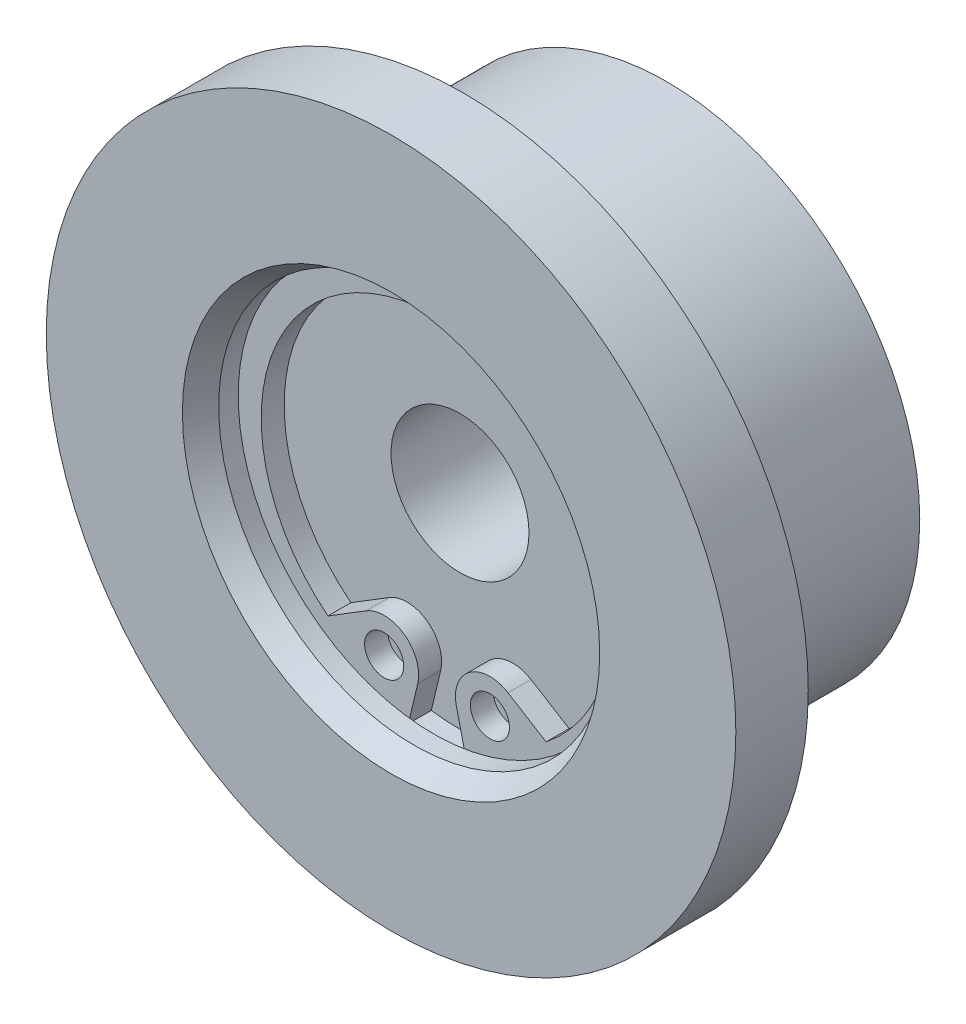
ISO-10303-21;
HEADER;
FILE_DESCRIPTION(('STEP AP214'),'2;1');
FILE_NAME('part.step','',(''),(''),'','','');
FILE_SCHEMA(('AUTOMOTIVE_DESIGN { 1 0 10303 214 1 1 1 1 }'));
ENDSEC;
DATA;
#1=APPLICATION_CONTEXT('core data for automotive mechanical design processes');
#2=APPLICATION_PROTOCOL_DEFINITION('international standard','automotive_design',2000,#1);
#3=PRODUCT_CONTEXT('',#1,'mechanical');
#4=PRODUCT('Part','Part','',(#3));
#5=PRODUCT_RELATED_PRODUCT_CATEGORY('part','',(#4));
#6=PRODUCT_DEFINITION_FORMATION('','',#4);
#7=PRODUCT_DEFINITION_CONTEXT('part definition',#1,'design');
#8=PRODUCT_DEFINITION('design','',#6,#7);
#9=PRODUCT_DEFINITION_SHAPE('','',#8);
#10=(LENGTH_UNIT() NAMED_UNIT(*) SI_UNIT(.MILLI.,.METRE.));
#11=(NAMED_UNIT(*) PLANE_ANGLE_UNIT() SI_UNIT($,.RADIAN.));
#12=(NAMED_UNIT(*) SI_UNIT($,.STERADIAN.) SOLID_ANGLE_UNIT());
#13=UNCERTAINTY_MEASURE_WITH_UNIT(LENGTH_MEASURE(1.E-05),#10,'distance_accuracy_value','');
#14=(GEOMETRIC_REPRESENTATION_CONTEXT(3) GLOBAL_UNCERTAINTY_ASSIGNED_CONTEXT((#13)) GLOBAL_UNIT_ASSIGNED_CONTEXT((#10,
#11,#12)) REPRESENTATION_CONTEXT('',''));
#15=CARTESIAN_POINT('',(0.,0.,0.));
#16=DIRECTION('',(0.,0.,1.));
#17=DIRECTION('',(1.,0.,0.));
#18=AXIS2_PLACEMENT_3D('',#15,#16,#17);
#19=CARTESIAN_POINT('',(0.,-0.5,4.));
#20=DIRECTION('',(0.,0.,1.));
#21=DIRECTION('',(-1.,0.,0.));
#22=AXIS2_PLACEMENT_3D('',#19,#20,#21);
#23=CYLINDRICAL_SURFACE('',#22,7.65);
#24=CARTESIAN_POINT('',(0.,-0.5,3.));
#25=DIRECTION('',(0.,0.,-1.));
#26=DIRECTION('',(0.,-1.,0.));
#27=AXIS2_PLACEMENT_3D('',#24,#25,#26);
#28=CIRCLE('',#27,7.65);
#29=CARTESIAN_POINT('',(-4.74513893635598,-6.50051301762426,3.));
#30=VERTEX_POINT('',#29);
#31=CARTESIAN_POINT('',(4.74513893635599,-6.50051301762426,3.));
#32=VERTEX_POINT('',#31);
#33=EDGE_CURVE('E110',#30,#32,#28,.T.);
#34=ORIENTED_EDGE('',*,*,#33,.T.);
#35=DIRECTION('',(0.,0.,-1.));
#36=VECTOR('',#35,1.);
#37=CARTESIAN_POINT('',(4.74513893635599,-6.50051301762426,4.));
#38=LINE('',#37,#36);
#39=CARTESIAN_POINT('',(4.74513893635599,-6.50051301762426,4.));
#40=VERTEX_POINT('',#39);
#41=EDGE_CURVE('E136',#40,#32,#38,.T.);
#42=ORIENTED_EDGE('',*,*,#41,.F.);
#43=CARTESIAN_POINT('',(0.,-0.5,4.));
#44=DIRECTION('',(0.,0.,-1.));
#45=DIRECTION('',(0.,-1.,0.));
#46=AXIS2_PLACEMENT_3D('',#43,#44,#45);
#47=CIRCLE('',#46,7.65);
#48=CARTESIAN_POINT('',(-4.74513893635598,-6.50051301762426,4.));
#49=VERTEX_POINT('',#48);
#50=EDGE_CURVE('E137',#49,#40,#47,.T.);
#51=ORIENTED_EDGE('',*,*,#50,.F.);
#52=DIRECTION('',(0.,0.,-1.));
#53=VECTOR('',#52,1.);
#54=CARTESIAN_POINT('',(-4.74513893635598,-6.50051301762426,4.));
#55=LINE('',#54,#53);
#56=EDGE_CURVE('E165',#49,#30,#55,.T.);
#57=ORIENTED_EDGE('',*,*,#56,.T.);
#58=EDGE_LOOP('',(#34,#42,#51,#57));
#59=FACE_BOUND('',#58,.T.);
#60=ADVANCED_FACE('F14',(#59),#23,.F.);
#61=CARTESIAN_POINT('',(3.08650226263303,-5.47917588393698,4.));
#62=DIRECTION('',(-0.524334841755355,-0.851512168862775,0.));
#63=DIRECTION('',(-0.851512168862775,0.524334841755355,0.));
#64=AXIS2_PLACEMENT_3D('',#61,#62,#63);
#65=PLANE('',#64);
#66=DIRECTION('',(-0.851512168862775,0.524334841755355,0.));
#67=VECTOR('',#66,1.);
#68=CARTESIAN_POINT('',(3.08650226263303,-5.47917588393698,3.));
#69=LINE('',#68,#67);
#70=CARTESIAN_POINT('',(3.08650226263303,-5.47917588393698,3.));
#71=VERTEX_POINT('',#70);
#72=EDGE_CURVE('E150',#32,#71,#69,.T.);
#73=ORIENTED_EDGE('',*,*,#72,.T.);
#74=DIRECTION('',(0.,0.,-1.));
#75=VECTOR('',#74,1.);
#76=CARTESIAN_POINT('',(3.08650226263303,-5.47917588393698,4.));
#77=LINE('',#76,#75);
#78=CARTESIAN_POINT('',(3.08650226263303,-5.47917588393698,4.));
#79=VERTEX_POINT('',#78);
#80=EDGE_CURVE('E145',#79,#71,#77,.T.);
#81=ORIENTED_EDGE('',*,*,#80,.F.);
#82=DIRECTION('',(-0.851512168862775,0.524334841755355,0.));
#83=VECTOR('',#82,1.);
#84=CARTESIAN_POINT('',(3.08650226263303,-5.47917588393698,4.));
#85=LINE('',#84,#83);
#86=EDGE_CURVE('E155',#40,#79,#85,.T.);
#87=ORIENTED_EDGE('',*,*,#86,.F.);
#88=ORIENTED_EDGE('',*,*,#41,.T.);
#89=EDGE_LOOP('',(#73,#81,#87,#88));
#90=FACE_BOUND('',#89,.T.);
#91=ADVANCED_FACE('F292',(#90),#65,.F.);
#92=CARTESIAN_POINT('',(2.3,-6.75644413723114,4.));
#93=DIRECTION('',(0.,0.,1.));
#94=DIRECTION('',(-1.,0.,0.));
#95=AXIS2_PLACEMENT_3D('',#92,#93,#94);
#96=CYLINDRICAL_SURFACE('',#95,1.5);
#97=CARTESIAN_POINT('',(2.3,-6.75644413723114,3.));
#98=DIRECTION('',(0.,0.,1.));
#99=DIRECTION('',(1.,0.,0.));
#100=AXIS2_PLACEMENT_3D('',#97,#98,#99);
#101=CIRCLE('',#100,1.5);
#102=CARTESIAN_POINT('',(0.840693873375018,-7.10346809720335,3.));
#103=VERTEX_POINT('',#102);
#104=EDGE_CURVE('E160',#71,#103,#101,.T.);
#105=ORIENTED_EDGE('',*,*,#104,.T.);
#106=DIRECTION('',(0.,0.,-1.));
#107=VECTOR('',#106,1.);
#108=CARTESIAN_POINT('',(0.840693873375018,-7.10346809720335,4.));
#109=LINE('',#108,#107);
#110=CARTESIAN_POINT('',(0.840693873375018,-7.10346809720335,4.));
#111=VERTEX_POINT('',#110);
#112=EDGE_CURVE('E146',#111,#103,#109,.T.);
#113=ORIENTED_EDGE('',*,*,#112,.F.);
#114=CARTESIAN_POINT('',(2.3,-6.75644413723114,4.));
#115=DIRECTION('',(0.,0.,1.));
#116=DIRECTION('',(1.,0.,0.));
#117=AXIS2_PLACEMENT_3D('',#114,#115,#116);
#118=CIRCLE('',#117,1.5);
#119=EDGE_CURVE('E151',#79,#111,#118,.T.);
#120=ORIENTED_EDGE('',*,*,#119,.F.);
#121=ORIENTED_EDGE('',*,*,#80,.T.);
#122=EDGE_LOOP('',(#105,#113,#120,#121));
#123=FACE_BOUND('',#122,.T.);
#124=ADVANCED_FACE('F238',(#123),#96,.T.);
#125=CARTESIAN_POINT('',(-0.84069387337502,-7.10346809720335,4.));
#126=DIRECTION('',(-0.97287075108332,0.231349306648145,0.));
#127=DIRECTION('',(0.,0.,1.));
#128=AXIS2_PLACEMENT_3D('',#125,#126,#127);
#129=PLANE('',#128);
#130=DIRECTION('',(0.,0.,1.));
#131=VECTOR('',#130,1.);
#132=CARTESIAN_POINT('',(-1.24703201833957,-8.81220240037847,8.6342229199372));
#133=LINE('',#132,#131);
#134=CARTESIAN_POINT('',(-1.24703201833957,-8.81220240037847,3.));
#135=VERTEX_POINT('',#134);
#136=CARTESIAN_POINT('',(-1.24703201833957,-8.81220240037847,4.));
#137=VERTEX_POINT('',#136);
#138=EDGE_CURVE('E115',#135,#137,#133,.T.);
#139=ORIENTED_EDGE('',*,*,#138,.F.);
#140=DIRECTION('',(0.231349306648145,0.97287075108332,0.));
#141=VECTOR('',#140,1.);
#142=CARTESIAN_POINT('',(-0.84069387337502,-7.10346809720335,3.));
#143=LINE('',#142,#141);
#144=CARTESIAN_POINT('',(-0.84069387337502,-7.10346809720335,3.));
#145=VERTEX_POINT('',#144);
#146=EDGE_CURVE('E103',#135,#145,#143,.T.);
#147=ORIENTED_EDGE('',*,*,#146,.T.);
#148=DIRECTION('',(0.,0.,-1.));
#149=VECTOR('',#148,1.);
#150=CARTESIAN_POINT('',(-0.84069387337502,-7.10346809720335,4.));
#151=LINE('',#150,#149);
#152=CARTESIAN_POINT('',(-0.84069387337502,-7.10346809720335,4.));
#153=VERTEX_POINT('',#152);
#154=EDGE_CURVE('E99',#153,#145,#151,.T.);
#155=ORIENTED_EDGE('',*,*,#154,.F.);
#156=DIRECTION('',(0.231349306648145,0.97287075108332,0.));
#157=VECTOR('',#156,1.);
#158=CARTESIAN_POINT('',(-0.84069387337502,-7.10346809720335,4.));
#159=LINE('',#158,#157);
#160=EDGE_CURVE('E141',#137,#153,#159,.T.);
#161=ORIENTED_EDGE('',*,*,#160,.F.);
#162=EDGE_LOOP('',(#139,#147,#155,#161));
#163=FACE_BOUND('',#162,.T.);
#164=ADVANCED_FACE('F259',(#163),#129,.F.);
#165=CARTESIAN_POINT('',(0.,-0.5,4.));
#166=DIRECTION('',(0.,0.,-1.));
#167=DIRECTION('',(0.,-1.,0.));
#168=AXIS2_PLACEMENT_3D('',#165,#166,#167);
#169=PLANE('',#168);
#170=CARTESIAN_POINT('',(2.3,-6.75644413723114,4.));
#171=DIRECTION('',(0.,0.,1.));
#172=DIRECTION('',(1.,0.,0.));
#173=AXIS2_PLACEMENT_3D('',#170,#171,#172);
#174=CIRCLE('',#173,0.85);
#175=CARTESIAN_POINT('',(3.15,-6.75644413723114,4.));
#176=VERTEX_POINT('',#175);
#177=EDGE_CURVE('E130',#176,#176,#174,.T.);
#178=ORIENTED_EDGE('',*,*,#177,.F.);
#179=EDGE_LOOP('',(#178));
#180=FACE_BOUND('',#179,.T.);
#181=CARTESIAN_POINT('',(-2.3,-6.75644413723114,4.));
#182=DIRECTION('',(0.,0.,-1.));
#183=DIRECTION('',(1.,0.,0.));
#184=AXIS2_PLACEMENT_3D('',#181,#182,#183);
#185=CIRCLE('',#184,0.85);
#186=CARTESIAN_POINT('',(-1.45,-6.75644413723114,4.));
#187=VERTEX_POINT('',#186);
#188=EDGE_CURVE('E142',#187,#187,#185,.T.);
#189=ORIENTED_EDGE('',*,*,#188,.T.);
#190=EDGE_LOOP('',(#189));
#191=FACE_BOUND('',#190,.T.);
#192=CARTESIAN_POINT('',(0.,0.,4.));
#193=DIRECTION('',(0.,0.,-1.));
#194=DIRECTION('',(-1.,0.,0.));
#195=AXIS2_PLACEMENT_3D('',#192,#193,#194);
#196=CIRCLE('',#195,8.9);
#197=CARTESIAN_POINT('',(1.24703201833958,-8.81220240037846,4.));
#198=VERTEX_POINT('',#197);
#199=EDGE_CURVE('E9',#137,#198,#196,.T.);
#200=ORIENTED_EDGE('',*,*,#199,.F.);
#201=ORIENTED_EDGE('',*,*,#160,.T.);
#202=CARTESIAN_POINT('',(-2.3,-6.75644413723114,4.));
#203=DIRECTION('',(0.,0.,1.));
#204=DIRECTION('',(-1.,0.,0.));
#205=AXIS2_PLACEMENT_3D('',#202,#203,#204);
#206=CIRCLE('',#205,1.5);
#207=CARTESIAN_POINT('',(-3.08650226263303,-5.47917588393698,4.));
#208=VERTEX_POINT('',#207);
#209=EDGE_CURVE('E138',#153,#208,#206,.T.);
#210=ORIENTED_EDGE('',*,*,#209,.T.);
#211=DIRECTION('',(-0.851512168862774,-0.524334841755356,0.));
#212=VECTOR('',#211,1.);
#213=CARTESIAN_POINT('',(-3.08650226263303,-5.47917588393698,4.));
#214=LINE('',#213,#212);
#215=EDGE_CURVE('E118',#208,#49,#214,.T.);
#216=ORIENTED_EDGE('',*,*,#215,.T.);
#217=ORIENTED_EDGE('',*,*,#50,.T.);
#218=ORIENTED_EDGE('',*,*,#86,.T.);
#219=ORIENTED_EDGE('',*,*,#119,.T.);
#220=DIRECTION('',(0.231349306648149,-0.972870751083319,0.));
#221=VECTOR('',#220,1.);
#222=CARTESIAN_POINT('',(0.840693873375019,-7.10346809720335,4.));
#223=LINE('',#222,#221);
#224=EDGE_CURVE('E156',#111,#198,#223,.T.);
#225=ORIENTED_EDGE('',*,*,#224,.T.);
#226=EDGE_LOOP('',(#200,#201,#210,#216,#217,#218,#219,#225));
#227=FACE_BOUND('',#226,.T.);
#228=ADVANCED_FACE('F255',(#180,#191,#227),#169,.F.);
#229=CARTESIAN_POINT('',(2.3,-6.75644413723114,4.));
#230=DIRECTION('',(0.,0.,1.));
#231=DIRECTION('',(-1.,0.,0.));
#232=AXIS2_PLACEMENT_3D('',#229,#230,#231);
#233=CYLINDRICAL_SURFACE('',#232,0.85);
#234=CARTESIAN_POINT('',(2.3,-6.75644413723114,3.));
#235=DIRECTION('',(0.,0.,1.));
#236=DIRECTION('',(1.,0.,0.));
#237=AXIS2_PLACEMENT_3D('',#234,#235,#236);
#238=CIRCLE('',#237,0.85);
#239=CARTESIAN_POINT('',(3.15,-6.75644413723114,3.));
#240=VERTEX_POINT('',#239);
#241=EDGE_CURVE('E120',#240,#240,#238,.T.);
#242=ORIENTED_EDGE('',*,*,#241,.F.);
#243=EDGE_LOOP('',(#242));
#244=FACE_BOUND('',#243,.T.);
#245=ORIENTED_EDGE('',*,*,#177,.T.);
#246=EDGE_LOOP('',(#245));
#247=FACE_BOUND('',#246,.T.);
#248=ADVANCED_FACE('F304',(#244,#247),#233,.F.);
#249=CARTESIAN_POINT('',(-2.3,-6.75644413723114,4.));
#250=DIRECTION('',(0.,0.,1.));
#251=DIRECTION('',(-1.,0.,0.));
#252=AXIS2_PLACEMENT_3D('',#249,#250,#251);
#253=CYLINDRICAL_SURFACE('',#252,0.85);
#254=CARTESIAN_POINT('',(-2.3,-6.75644413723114,3.));
#255=DIRECTION('',(0.,0.,-1.));
#256=DIRECTION('',(1.,0.,0.));
#257=AXIS2_PLACEMENT_3D('',#254,#255,#256);
#258=CIRCLE('',#257,0.85);
#259=CARTESIAN_POINT('',(-1.45,-6.75644413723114,3.));
#260=VERTEX_POINT('',#259);
#261=EDGE_CURVE('E133',#260,#260,#258,.T.);
#262=ORIENTED_EDGE('',*,*,#261,.T.);
#263=EDGE_LOOP('',(#262));
#264=FACE_BOUND('',#263,.T.);
#265=ORIENTED_EDGE('',*,*,#188,.F.);
#266=EDGE_LOOP('',(#265));
#267=FACE_BOUND('',#266,.T.);
#268=ADVANCED_FACE('F489',(#264,#267),#253,.F.);
#269=CARTESIAN_POINT('',(-3.08650226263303,-5.47917588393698,4.));
#270=DIRECTION('',(0.524334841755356,-0.851512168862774,0.));
#271=DIRECTION('',(0.,0.,-1.));
#272=AXIS2_PLACEMENT_3D('',#269,#270,#271);
#273=PLANE('',#272);
#274=DIRECTION('',(-0.851512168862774,-0.524334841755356,0.));
#275=VECTOR('',#274,1.);
#276=CARTESIAN_POINT('',(-3.08650226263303,-5.47917588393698,3.));
#277=LINE('',#276,#275);
#278=CARTESIAN_POINT('',(-3.08650226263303,-5.47917588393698,3.));
#279=VERTEX_POINT('',#278);
#280=EDGE_CURVE('E106',#279,#30,#277,.T.);
#281=ORIENTED_EDGE('',*,*,#280,.T.);
#282=ORIENTED_EDGE('',*,*,#56,.F.);
#283=ORIENTED_EDGE('',*,*,#215,.F.);
#284=DIRECTION('',(0.,0.,-1.));
#285=VECTOR('',#284,1.);
#286=CARTESIAN_POINT('',(-3.08650226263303,-5.47917588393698,4.));
#287=LINE('',#286,#285);
#288=EDGE_CURVE('E96',#208,#279,#287,.T.);
#289=ORIENTED_EDGE('',*,*,#288,.T.);
#290=EDGE_LOOP('',(#281,#282,#283,#289));
#291=FACE_BOUND('',#290,.T.);
#292=ADVANCED_FACE('F117',(#291),#273,.F.);
#293=CARTESIAN_POINT('',(-2.3,-6.75644413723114,4.));
#294=DIRECTION('',(0.,0.,1.));
#295=DIRECTION('',(-1.,0.,0.));
#296=AXIS2_PLACEMENT_3D('',#293,#294,#295);
#297=CYLINDRICAL_SURFACE('',#296,1.5);
#298=CARTESIAN_POINT('',(-2.3,-6.75644413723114,3.));
#299=DIRECTION('',(0.,0.,1.));
#300=DIRECTION('',(-1.,0.,0.));
#301=AXIS2_PLACEMENT_3D('',#298,#299,#300);
#302=CIRCLE('',#301,1.5);
#303=EDGE_CURVE('E91',#145,#279,#302,.T.);
#304=ORIENTED_EDGE('',*,*,#303,.T.);
#305=ORIENTED_EDGE('',*,*,#288,.F.);
#306=ORIENTED_EDGE('',*,*,#209,.F.);
#307=ORIENTED_EDGE('',*,*,#154,.T.);
#308=EDGE_LOOP('',(#304,#305,#306,#307));
#309=FACE_BOUND('',#308,.T.);
#310=ADVANCED_FACE('F93',(#309),#297,.T.);
#311=CARTESIAN_POINT('',(0.840693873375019,-7.10346809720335,4.));
#312=DIRECTION('',(0.972870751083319,0.231349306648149,0.));
#313=DIRECTION('',(0.,0.,-1.));
#314=AXIS2_PLACEMENT_3D('',#311,#312,#313);
#315=PLANE('',#314);
#316=DIRECTION('',(0.,0.,1.));
#317=VECTOR('',#316,1.);
#318=CARTESIAN_POINT('',(1.24703201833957,-8.81220240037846,8.6342229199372));
#319=LINE('',#318,#317);
#320=CARTESIAN_POINT('',(1.24703201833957,-8.81220240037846,3.));
#321=VERTEX_POINT('',#320);
#322=EDGE_CURVE('E18',#198,#321,#319,.F.);
#323=ORIENTED_EDGE('',*,*,#322,.F.);
#324=ORIENTED_EDGE('',*,*,#224,.F.);
#325=ORIENTED_EDGE('',*,*,#112,.T.);
#326=DIRECTION('',(0.231349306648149,-0.972870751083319,0.));
#327=VECTOR('',#326,1.);
#328=CARTESIAN_POINT('',(0.840693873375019,-7.10346809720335,3.));
#329=LINE('',#328,#327);
#330=EDGE_CURVE('E32',#103,#321,#329,.T.);
#331=ORIENTED_EDGE('',*,*,#330,.T.);
#332=EDGE_LOOP('',(#323,#324,#325,#331));
#333=FACE_BOUND('',#332,.T.);
#334=ADVANCED_FACE('F241',(#333),#315,.F.);
#335=CARTESIAN_POINT('',(0.,3.,3.));
#336=DIRECTION('',(0.,0.,-1.));
#337=DIRECTION('',(-1.,0.,0.));
#338=AXIS2_PLACEMENT_3D('',#335,#336,#337);
#339=PLANE('',#338);
#340=ORIENTED_EDGE('',*,*,#241,.T.);
#341=EDGE_LOOP('',(#340));
#342=FACE_BOUND('',#341,.T.);
#343=ADVANCED_FACE('F278',(#342),#339,.F.);
#344=ORIENTED_EDGE('',*,*,#261,.F.);
#345=EDGE_LOOP('',(#344));
#346=FACE_BOUND('',#345,.T.);
#347=ADVANCED_FACE('F280',(#346),#339,.F.);
#348=CARTESIAN_POINT('',(0.,0.,2.5));
#349=DIRECTION('',(0.,0.,1.));
#350=DIRECTION('',(1.,0.,0.));
#351=AXIS2_PLACEMENT_3D('',#348,#349,#350);
#352=CONICAL_SURFACE('',#351,11.,1.48352986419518);
#353=CARTESIAN_POINT('',(0.,0.,2.84995465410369));
#354=DIRECTION('',(0.,0.,1.));
#355=DIRECTION('',(1.,0.,0.));
#356=AXIS2_PLACEMENT_3D('',#353,#354,#355);
#357=CIRCLE('',#356,15.);
#358=CARTESIAN_POINT('',(15.,0.,2.84995465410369));
#359=VERTEX_POINT('',#358);
#360=EDGE_CURVE('E172',#359,#359,#357,.T.);
#361=ORIENTED_EDGE('',*,*,#360,.F.);
#362=EDGE_LOOP('',(#361));
#363=FACE_BOUND('',#362,.T.);
#364=CARTESIAN_POINT('',(0.,0.,2.5));
#365=DIRECTION('',(0.,0.,1.));
#366=DIRECTION('',(1.,0.,0.));
#367=AXIS2_PLACEMENT_3D('',#364,#365,#366);
#368=CIRCLE('',#367,11.);
#369=CARTESIAN_POINT('',(11.,0.,2.5));
#370=VERTEX_POINT('',#369);
#371=EDGE_CURVE('E205',#370,#370,#368,.T.);
#372=ORIENTED_EDGE('',*,*,#371,.T.);
#373=EDGE_LOOP('',(#372));
#374=FACE_BOUND('',#373,.T.);
#375=ADVANCED_FACE('F286',(#363,#374),#352,.T.);
#376=CARTESIAN_POINT('',(0.,0.,8.6342229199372));
#377=DIRECTION('',(0.,0.,1.));
#378=DIRECTION('',(1.,0.,0.));
#379=AXIS2_PLACEMENT_3D('',#376,#377,#378);
#380=CYLINDRICAL_SURFACE('',#379,15.);
#381=CARTESIAN_POINT('',(0.,0.,6.));
#382=DIRECTION('',(0.,0.,1.));
#383=DIRECTION('',(1.,0.,0.));
#384=AXIS2_PLACEMENT_3D('',#381,#382,#383);
#385=CIRCLE('',#384,15.);
#386=CARTESIAN_POINT('',(15.,0.,6.));
#387=VERTEX_POINT('',#386);
#388=EDGE_CURVE('E202',#387,#387,#385,.T.);
#389=ORIENTED_EDGE('',*,*,#388,.F.);
#390=EDGE_LOOP('',(#389));
#391=FACE_BOUND('',#390,.T.);
#392=ORIENTED_EDGE('',*,*,#360,.T.);
#393=EDGE_LOOP('',(#392));
#394=FACE_BOUND('',#393,.T.);
#395=ADVANCED_FACE('F310',(#391,#394),#380,.T.);
#396=CARTESIAN_POINT('',(0.,0.,8.6342229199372));
#397=DIRECTION('',(0.,0.,1.));
#398=DIRECTION('',(1.,0.,0.));
#399=AXIS2_PLACEMENT_3D('',#396,#397,#398);
#400=CYLINDRICAL_SURFACE('',#399,11.);
#401=CARTESIAN_POINT('',(0.,0.,-6.));
#402=DIRECTION('',(0.,0.,1.));
#403=DIRECTION('',(1.,0.,0.));
#404=AXIS2_PLACEMENT_3D('',#401,#402,#403);
#405=CIRCLE('',#404,11.);
#406=CARTESIAN_POINT('',(11.,0.,-6.));
#407=VERTEX_POINT('',#406);
#408=EDGE_CURVE('E175',#407,#407,#405,.T.);
#409=ORIENTED_EDGE('',*,*,#408,.T.);
#410=EDGE_LOOP('',(#409));
#411=FACE_BOUND('',#410,.T.);
#412=ORIENTED_EDGE('',*,*,#371,.F.);
#413=EDGE_LOOP('',(#412));
#414=FACE_BOUND('',#413,.T.);
#415=ADVANCED_FACE('F16',(#411,#414),#400,.T.);
#416=CARTESIAN_POINT('',(0.,15.,6.));
#417=DIRECTION('',(0.,0.,-1.));
#418=DIRECTION('',(-1.,0.,0.));
#419=AXIS2_PLACEMENT_3D('',#416,#417,#418);
#420=PLANE('',#419);
#421=CARTESIAN_POINT('',(0.,0.,6.));
#422=DIRECTION('',(0.,0.,1.));
#423=DIRECTION('',(1.,0.,0.));
#424=AXIS2_PLACEMENT_3D('',#421,#422,#423);
#425=CIRCLE('',#424,9.07735026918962);
#426=CARTESIAN_POINT('',(9.07735026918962,0.,6.));
#427=VERTEX_POINT('',#426);
#428=EDGE_CURVE('E199',#427,#427,#425,.T.);
#429=ORIENTED_EDGE('',*,*,#428,.F.);
#430=EDGE_LOOP('',(#429));
#431=FACE_BOUND('',#430,.T.);
#432=ORIENTED_EDGE('',*,*,#388,.T.);
#433=EDGE_LOOP('',(#432));
#434=FACE_BOUND('',#433,.T.);
#435=ADVANCED_FACE('F316',(#431,#434),#420,.F.);
#436=CARTESIAN_POINT('',(0.,6.5,-6.));
#437=DIRECTION('',(0.,0.,1.));
#438=DIRECTION('',(1.,0.,0.));
#439=AXIS2_PLACEMENT_3D('',#436,#437,#438);
#440=PLANE('',#439);
#441=CARTESIAN_POINT('',(0.,0.,-6.));
#442=DIRECTION('',(0.,0.,1.));
#443=DIRECTION('',(1.,0.,0.));
#444=AXIS2_PLACEMENT_3D('',#441,#442,#443);
#445=CIRCLE('',#444,6.5);
#446=CARTESIAN_POINT('',(6.5,0.,-6.));
#447=VERTEX_POINT('',#446);
#448=EDGE_CURVE('E176',#447,#447,#445,.T.);
#449=ORIENTED_EDGE('',*,*,#448,.T.);
#450=EDGE_LOOP('',(#449));
#451=FACE_BOUND('',#450,.T.);
#452=ORIENTED_EDGE('',*,*,#408,.F.);
#453=EDGE_LOOP('',(#452));
#454=FACE_BOUND('',#453,.T.);
#455=ADVANCED_FACE('F312',(#451,#454),#440,.F.);
#456=CARTESIAN_POINT('',(0.,0.,6.));
#457=DIRECTION('',(0.,0.,1.));
#458=DIRECTION('',(1.,0.,0.));
#459=AXIS2_PLACEMENT_3D('',#456,#457,#458);
#460=CONICAL_SURFACE('',#459,9.07735026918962,0.523598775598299);
#461=CARTESIAN_POINT('',(0.,0.,5.));
#462=DIRECTION('',(0.,0.,1.));
#463=DIRECTION('',(1.,0.,0.));
#464=AXIS2_PLACEMENT_3D('',#461,#462,#463);
#465=CIRCLE('',#464,8.5);
#466=CARTESIAN_POINT('',(8.5,0.,5.));
#467=VERTEX_POINT('',#466);
#468=EDGE_CURVE('E196',#467,#467,#465,.T.);
#469=ORIENTED_EDGE('',*,*,#468,.F.);
#470=EDGE_LOOP('',(#469));
#471=FACE_BOUND('',#470,.T.);
#472=ORIENTED_EDGE('',*,*,#428,.T.);
#473=EDGE_LOOP('',(#472));
#474=FACE_BOUND('',#473,.T.);
#475=ADVANCED_FACE('F315',(#471,#474),#460,.F.);
#476=CARTESIAN_POINT('',(0.,0.,8.6342229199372));
#477=DIRECTION('',(0.,0.,1.));
#478=DIRECTION('',(1.,0.,0.));
#479=AXIS2_PLACEMENT_3D('',#476,#477,#478);
#480=CYLINDRICAL_SURFACE('',#479,6.5);
#481=ORIENTED_EDGE('',*,*,#448,.F.);
#482=EDGE_LOOP('',(#481));
#483=FACE_BOUND('',#482,.T.);
#484=CARTESIAN_POINT('',(0.,0.,-3.));
#485=DIRECTION('',(0.,0.,1.));
#486=DIRECTION('',(1.,0.,0.));
#487=AXIS2_PLACEMENT_3D('',#484,#485,#486);
#488=CIRCLE('',#487,6.5);
#489=CARTESIAN_POINT('',(6.5,0.,-3.));
#490=VERTEX_POINT('',#489);
#491=EDGE_CURVE('E179',#490,#490,#488,.T.);
#492=ORIENTED_EDGE('',*,*,#491,.T.);
#493=EDGE_LOOP('',(#492));
#494=FACE_BOUND('',#493,.T.);
#495=ADVANCED_FACE('F318',(#483,#494),#480,.F.);
#496=CARTESIAN_POINT('',(0.,0.,8.6342229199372));
#497=DIRECTION('',(0.,0.,1.));
#498=DIRECTION('',(1.,0.,0.));
#499=AXIS2_PLACEMENT_3D('',#496,#497,#498);
#500=CYLINDRICAL_SURFACE('',#499,8.5);
#501=CARTESIAN_POINT('',(0.,0.,4.15));
#502=DIRECTION('',(0.,0.,1.));
#503=DIRECTION('',(1.,0.,0.));
#504=AXIS2_PLACEMENT_3D('',#501,#502,#503);
#505=CIRCLE('',#504,8.5);
#506=CARTESIAN_POINT('',(8.5,0.,4.15));
#507=VERTEX_POINT('',#506);
#508=EDGE_CURVE('E193',#507,#507,#505,.T.);
#509=ORIENTED_EDGE('',*,*,#508,.F.);
#510=EDGE_LOOP('',(#509));
#511=FACE_BOUND('',#510,.T.);
#512=ORIENTED_EDGE('',*,*,#468,.T.);
#513=EDGE_LOOP('',(#512));
#514=FACE_BOUND('',#513,.T.);
#515=ADVANCED_FACE('F321',(#511,#514),#500,.F.);
#516=CARTESIAN_POINT('',(0.,6.5,-3.));
#517=DIRECTION('',(0.,0.,1.));
#518=DIRECTION('',(1.,0.,0.));
#519=AXIS2_PLACEMENT_3D('',#516,#517,#518);
#520=PLANE('',#519);
#521=ORIENTED_EDGE('',*,*,#491,.F.);
#522=EDGE_LOOP('',(#521));
#523=FACE_BOUND('',#522,.T.);
#524=CARTESIAN_POINT('',(0.,0.,-3.));
#525=DIRECTION('',(0.,0.,1.));
#526=DIRECTION('',(1.,0.,0.));
#527=AXIS2_PLACEMENT_3D('',#524,#525,#526);
#528=CIRCLE('',#527,3.);
#529=CARTESIAN_POINT('',(3.,0.,-3.));
#530=VERTEX_POINT('',#529);
#531=EDGE_CURVE('E182',#530,#530,#528,.T.);
#532=ORIENTED_EDGE('',*,*,#531,.T.);
#533=EDGE_LOOP('',(#532));
#534=FACE_BOUND('',#533,.T.);
#535=ADVANCED_FACE('F274',(#523,#534),#520,.F.);
#536=CARTESIAN_POINT('',(0.,8.9,4.15));
#537=DIRECTION('',(0.,0.,1.));
#538=DIRECTION('',(1.,0.,0.));
#539=AXIS2_PLACEMENT_3D('',#536,#537,#538);
#540=PLANE('',#539);
#541=CARTESIAN_POINT('',(0.,0.,4.15));
#542=DIRECTION('',(0.,0.,1.));
#543=DIRECTION('',(1.,0.,0.));
#544=AXIS2_PLACEMENT_3D('',#541,#542,#543);
#545=CIRCLE('',#544,8.9);
#546=CARTESIAN_POINT('',(8.9,0.,4.15));
#547=VERTEX_POINT('',#546);
#548=EDGE_CURVE('E190',#547,#547,#545,.T.);
#549=ORIENTED_EDGE('',*,*,#548,.F.);
#550=EDGE_LOOP('',(#549));
#551=FACE_BOUND('',#550,.T.);
#552=ORIENTED_EDGE('',*,*,#508,.T.);
#553=EDGE_LOOP('',(#552));
#554=FACE_BOUND('',#553,.T.);
#555=ADVANCED_FACE('F264',(#551,#554),#540,.F.);
#556=CARTESIAN_POINT('',(0.,0.,8.6342229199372));
#557=DIRECTION('',(0.,0.,1.));
#558=DIRECTION('',(1.,0.,0.));
#559=AXIS2_PLACEMENT_3D('',#556,#557,#558);
#560=CYLINDRICAL_SURFACE('',#559,8.9);
#561=ORIENTED_EDGE('',*,*,#548,.T.);
#562=EDGE_LOOP('',(#561));
#563=FACE_BOUND('',#562,.T.);
#564=ORIENTED_EDGE('',*,*,#199,.T.);
#565=ORIENTED_EDGE('',*,*,#322,.T.);
#566=CARTESIAN_POINT('',(0.,0.,3.));
#567=DIRECTION('',(0.,0.,1.));
#568=DIRECTION('',(1.,0.,0.));
#569=AXIS2_PLACEMENT_3D('',#566,#567,#568);
#570=CIRCLE('',#569,8.9);
#571=EDGE_CURVE('E188',#135,#321,#570,.T.);
#572=ORIENTED_EDGE('',*,*,#571,.F.);
#573=ORIENTED_EDGE('',*,*,#138,.T.);
#574=EDGE_LOOP('',(#564,#565,#572,#573));
#575=FACE_BOUND('',#574,.T.);
#576=ADVANCED_FACE('F261',(#563,#575),#560,.F.);
#577=CARTESIAN_POINT('',(0.,0.,8.6342229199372));
#578=DIRECTION('',(0.,0.,1.));
#579=DIRECTION('',(1.,0.,0.));
#580=AXIS2_PLACEMENT_3D('',#577,#578,#579);
#581=CYLINDRICAL_SURFACE('',#580,3.);
#582=ORIENTED_EDGE('',*,*,#531,.F.);
#583=EDGE_LOOP('',(#582));
#584=FACE_BOUND('',#583,.T.);
#585=CARTESIAN_POINT('',(0.,0.,3.));
#586=DIRECTION('',(0.,0.,1.));
#587=DIRECTION('',(1.,0.,0.));
#588=AXIS2_PLACEMENT_3D('',#585,#586,#587);
#589=CIRCLE('',#588,3.);
#590=CARTESIAN_POINT('',(3.,0.,3.));
#591=VERTEX_POINT('',#590);
#592=EDGE_CURVE('E185',#591,#591,#589,.T.);
#593=ORIENTED_EDGE('',*,*,#592,.T.);
#594=EDGE_LOOP('',(#593));
#595=FACE_BOUND('',#594,.T.);
#596=ADVANCED_FACE('F263',(#584,#595),#581,.F.);
#597=ORIENTED_EDGE('',*,*,#592,.F.);
#598=EDGE_LOOP('',(#597));
#599=FACE_BOUND('',#598,.T.);
#600=ORIENTED_EDGE('',*,*,#571,.T.);
#601=ORIENTED_EDGE('',*,*,#330,.F.);
#602=ORIENTED_EDGE('',*,*,#104,.F.);
#603=ORIENTED_EDGE('',*,*,#72,.F.);
#604=ORIENTED_EDGE('',*,*,#33,.F.);
#605=ORIENTED_EDGE('',*,*,#280,.F.);
#606=ORIENTED_EDGE('',*,*,#303,.F.);
#607=ORIENTED_EDGE('',*,*,#146,.F.);
#608=EDGE_LOOP('',(#600,#601,#602,#603,#604,#605,#606,#607));
#609=FACE_BOUND('',#608,.T.);
#610=ADVANCED_FACE('F108',(#599,#609),#339,.F.);
#611=CLOSED_SHELL('',(#60,#91,#124,#164,#228,#248,#268,#292,#310,#334,#343,#347,#375,#395,#415,
#435,#455,#475,#495,#515,#535,#555,#576,#596,#610));
#612=MANIFOLD_SOLID_BREP('B1',#611);
#613=ADVANCED_BREP_SHAPE_REPRESENTATION('',(#18,#612),#14);
#614=SHAPE_DEFINITION_REPRESENTATION(#9,#613);
ENDSEC;
END-ISO-10303-21;
